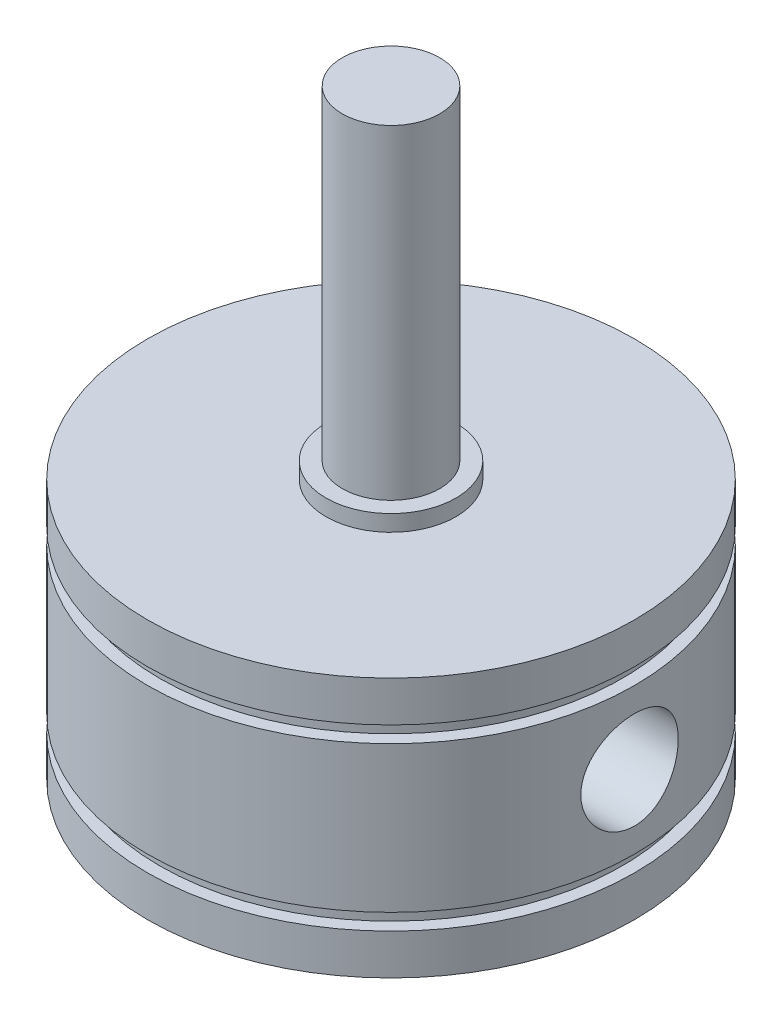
ISO-10303-21;
HEADER;
FILE_DESCRIPTION(('STEP AP214'),'2;1');
FILE_NAME('part.step','',(''),(''),'','','');
FILE_SCHEMA(('AUTOMOTIVE_DESIGN { 1 0 10303 214 1 1 1 1 }'));
ENDSEC;
DATA;
#1=APPLICATION_CONTEXT('core data for automotive mechanical design processes');
#2=APPLICATION_PROTOCOL_DEFINITION('international standard','automotive_design',2000,#1);
#3=PRODUCT_CONTEXT('',#1,'mechanical');
#4=PRODUCT('Part','Part','',(#3));
#5=PRODUCT_RELATED_PRODUCT_CATEGORY('part','',(#4));
#6=PRODUCT_DEFINITION_FORMATION('','',#4);
#7=PRODUCT_DEFINITION_CONTEXT('part definition',#1,'design');
#8=PRODUCT_DEFINITION('design','',#6,#7);
#9=PRODUCT_DEFINITION_SHAPE('','',#8);
#10=(LENGTH_UNIT() NAMED_UNIT(*) SI_UNIT(.MILLI.,.METRE.));
#11=(NAMED_UNIT(*) PLANE_ANGLE_UNIT() SI_UNIT($,.RADIAN.));
#12=(NAMED_UNIT(*) SI_UNIT($,.STERADIAN.) SOLID_ANGLE_UNIT());
#13=UNCERTAINTY_MEASURE_WITH_UNIT(LENGTH_MEASURE(1.E-05),#10,'distance_accuracy_value','');
#14=(GEOMETRIC_REPRESENTATION_CONTEXT(3) GLOBAL_UNCERTAINTY_ASSIGNED_CONTEXT((#13)) GLOBAL_UNIT_ASSIGNED_CONTEXT((#10,
#11,#12)) REPRESENTATION_CONTEXT('',''));
#15=CARTESIAN_POINT('',(0.,0.,0.));
#16=DIRECTION('',(0.,0.,1.));
#17=DIRECTION('',(1.,0.,0.));
#18=AXIS2_PLACEMENT_3D('',#15,#16,#17);
#19=CARTESIAN_POINT('',(3.,0.,0.));
#20=DIRECTION('',(0.,1.,0.));
#21=DIRECTION('',(0.,0.,1.));
#22=AXIS2_PLACEMENT_3D('',#19,#20,#21);
#23=PLANE('',#22);
#24=CARTESIAN_POINT('',(0.,0.,0.));
#25=DIRECTION('',(0.,1.,0.));
#26=DIRECTION('',(0.,0.,1.));
#27=AXIS2_PLACEMENT_3D('',#24,#25,#26);
#28=CIRCLE('',#27,3.);
#29=CARTESIAN_POINT('',(0.,0.,3.));
#30=VERTEX_POINT('',#29);
#31=EDGE_CURVE('E126',#30,#30,#28,.T.);
#32=ORIENTED_EDGE('',*,*,#31,.F.);
#33=EDGE_LOOP('',(#32));
#34=FACE_BOUND('',#33,.T.);
#35=ADVANCED_FACE('F33',(#34),#23,.F.);
#36=CARTESIAN_POINT('',(0.,41.,0.));
#37=DIRECTION('',(0.,-1.,0.));
#38=DIRECTION('',(0.,0.,-1.));
#39=AXIS2_PLACEMENT_3D('',#36,#37,#38);
#40=PLANE('',#39);
#41=CARTESIAN_POINT('',(0.,41.,0.));
#42=DIRECTION('',(0.,1.,0.));
#43=DIRECTION('',(0.,0.,1.));
#44=AXIS2_PLACEMENT_3D('',#41,#42,#43);
#45=CIRCLE('',#44,3.);
#46=CARTESIAN_POINT('',(0.,41.,3.));
#47=VERTEX_POINT('',#46);
#48=EDGE_CURVE('E63',#47,#47,#45,.T.);
#49=ORIENTED_EDGE('',*,*,#48,.T.);
#50=EDGE_LOOP('',(#49));
#51=FACE_BOUND('',#50,.T.);
#52=ADVANCED_FACE('F117',(#51),#40,.F.);
#53=CARTESIAN_POINT('',(0.,52.8834340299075,0.));
#54=DIRECTION('',(0.,1.,0.));
#55=DIRECTION('',(0.,0.,1.));
#56=AXIS2_PLACEMENT_3D('',#53,#54,#55);
#57=CYLINDRICAL_SURFACE('',#56,3.);
#58=ORIENTED_EDGE('',*,*,#48,.F.);
#59=EDGE_LOOP('',(#58));
#60=FACE_BOUND('',#59,.T.);
#61=CARTESIAN_POINT('',(0.,21.,0.));
#62=DIRECTION('',(0.,1.,0.));
#63=DIRECTION('',(0.,0.,1.));
#64=AXIS2_PLACEMENT_3D('',#61,#62,#63);
#65=CIRCLE('',#64,3.);
#66=CARTESIAN_POINT('',(0.,21.,3.));
#67=VERTEX_POINT('',#66);
#68=EDGE_CURVE('E180',#67,#67,#65,.T.);
#69=ORIENTED_EDGE('',*,*,#68,.T.);
#70=EDGE_LOOP('',(#69));
#71=FACE_BOUND('',#70,.T.);
#72=ADVANCED_FACE('F122',(#60,#71),#57,.T.);
#73=CARTESIAN_POINT('',(3.,21.,0.));
#74=DIRECTION('',(0.,-1.,0.));
#75=DIRECTION('',(0.,0.,-1.));
#76=AXIS2_PLACEMENT_3D('',#73,#74,#75);
#77=PLANE('',#76);
#78=ORIENTED_EDGE('',*,*,#68,.F.);
#79=EDGE_LOOP('',(#78));
#80=FACE_BOUND('',#79,.T.);
#81=CARTESIAN_POINT('',(0.,21.,0.));
#82=DIRECTION('',(0.,1.,0.));
#83=DIRECTION('',(0.,0.,1.));
#84=AXIS2_PLACEMENT_3D('',#81,#82,#83);
#85=CIRCLE('',#84,4.);
#86=CARTESIAN_POINT('',(0.,21.,4.));
#87=VERTEX_POINT('',#86);
#88=EDGE_CURVE('E177',#87,#87,#85,.T.);
#89=ORIENTED_EDGE('',*,*,#88,.T.);
#90=EDGE_LOOP('',(#89));
#91=FACE_BOUND('',#90,.T.);
#92=ADVANCED_FACE('F187',(#80,#91),#77,.F.);
#93=CARTESIAN_POINT('',(0.,52.8834340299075,0.));
#94=DIRECTION('',(0.,1.,0.));
#95=DIRECTION('',(0.,0.,1.));
#96=AXIS2_PLACEMENT_3D('',#93,#94,#95);
#97=CYLINDRICAL_SURFACE('',#96,4.);
#98=ORIENTED_EDGE('',*,*,#88,.F.);
#99=EDGE_LOOP('',(#98));
#100=FACE_BOUND('',#99,.T.);
#101=CARTESIAN_POINT('',(0.,20.,0.));
#102=DIRECTION('',(0.,1.,0.));
#103=DIRECTION('',(0.,0.,1.));
#104=AXIS2_PLACEMENT_3D('',#101,#102,#103);
#105=CIRCLE('',#104,4.);
#106=CARTESIAN_POINT('',(0.,20.,4.));
#107=VERTEX_POINT('',#106);
#108=EDGE_CURVE('E174',#107,#107,#105,.T.);
#109=ORIENTED_EDGE('',*,*,#108,.T.);
#110=EDGE_LOOP('',(#109));
#111=FACE_BOUND('',#110,.T.);
#112=ADVANCED_FACE('F193',(#100,#111),#97,.T.);
#113=CARTESIAN_POINT('',(4.,20.,0.));
#114=DIRECTION('',(0.,-1.,0.));
#115=DIRECTION('',(0.,0.,-1.));
#116=AXIS2_PLACEMENT_3D('',#113,#114,#115);
#117=PLANE('',#116);
#118=ORIENTED_EDGE('',*,*,#108,.F.);
#119=EDGE_LOOP('',(#118));
#120=FACE_BOUND('',#119,.T.);
#121=CARTESIAN_POINT('',(0.,20.,0.));
#122=DIRECTION('',(0.,1.,0.));
#123=DIRECTION('',(0.,0.,1.));
#124=AXIS2_PLACEMENT_3D('',#121,#122,#123);
#125=CIRCLE('',#124,15.);
#126=CARTESIAN_POINT('',(0.,20.,15.));
#127=VERTEX_POINT('',#126);
#128=EDGE_CURVE('E171',#127,#127,#125,.T.);
#129=ORIENTED_EDGE('',*,*,#128,.T.);
#130=EDGE_LOOP('',(#129));
#131=FACE_BOUND('',#130,.T.);
#132=ADVANCED_FACE('F199',(#120,#131),#117,.F.);
#133=CARTESIAN_POINT('',(0.,52.8834340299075,0.));
#134=DIRECTION('',(0.,1.,0.));
#135=DIRECTION('',(0.,0.,1.));
#136=AXIS2_PLACEMENT_3D('',#133,#134,#135);
#137=CYLINDRICAL_SURFACE('',#136,15.);
#138=ORIENTED_EDGE('',*,*,#128,.F.);
#139=EDGE_LOOP('',(#138));
#140=FACE_BOUND('',#139,.T.);
#141=CARTESIAN_POINT('',(0.,17.5,0.));
#142=DIRECTION('',(0.,1.,0.));
#143=DIRECTION('',(0.,0.,1.));
#144=AXIS2_PLACEMENT_3D('',#141,#142,#143);
#145=CIRCLE('',#144,15.);
#146=CARTESIAN_POINT('',(0.,17.5,15.));
#147=VERTEX_POINT('',#146);
#148=EDGE_CURVE('E168',#147,#147,#145,.T.);
#149=ORIENTED_EDGE('',*,*,#148,.T.);
#150=EDGE_LOOP('',(#149));
#151=FACE_BOUND('',#150,.T.);
#152=ADVANCED_FACE('F205',(#140,#151),#137,.T.);
#153=CARTESIAN_POINT('',(15.,17.5,0.));
#154=DIRECTION('',(0.,1.,0.));
#155=DIRECTION('',(0.,0.,1.));
#156=AXIS2_PLACEMENT_3D('',#153,#154,#155);
#157=PLANE('',#156);
#158=ORIENTED_EDGE('',*,*,#148,.F.);
#159=EDGE_LOOP('',(#158));
#160=FACE_BOUND('',#159,.T.);
#161=CARTESIAN_POINT('',(0.,17.5,0.));
#162=DIRECTION('',(0.,1.,0.));
#163=DIRECTION('',(0.,0.,1.));
#164=AXIS2_PLACEMENT_3D('',#161,#162,#163);
#165=CIRCLE('',#164,14.25);
#166=CARTESIAN_POINT('',(0.,17.5,14.25));
#167=VERTEX_POINT('',#166);
#168=EDGE_CURVE('E165',#167,#167,#165,.T.);
#169=ORIENTED_EDGE('',*,*,#168,.T.);
#170=EDGE_LOOP('',(#169));
#171=FACE_BOUND('',#170,.T.);
#172=ADVANCED_FACE('F211',(#160,#171),#157,.F.);
#173=CARTESIAN_POINT('',(0.,52.8834340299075,0.));
#174=DIRECTION('',(0.,1.,0.));
#175=DIRECTION('',(0.,0.,1.));
#176=AXIS2_PLACEMENT_3D('',#173,#174,#175);
#177=CYLINDRICAL_SURFACE('',#176,14.25);
#178=ORIENTED_EDGE('',*,*,#168,.F.);
#179=EDGE_LOOP('',(#178));
#180=FACE_BOUND('',#179,.T.);
#181=CARTESIAN_POINT('',(0.,16.5,0.));
#182=DIRECTION('',(0.,1.,0.));
#183=DIRECTION('',(0.,0.,1.));
#184=AXIS2_PLACEMENT_3D('',#181,#182,#183);
#185=CIRCLE('',#184,14.25);
#186=CARTESIAN_POINT('',(0.,16.5,14.25));
#187=VERTEX_POINT('',#186);
#188=EDGE_CURVE('E162',#187,#187,#185,.T.);
#189=ORIENTED_EDGE('',*,*,#188,.T.);
#190=EDGE_LOOP('',(#189));
#191=FACE_BOUND('',#190,.T.);
#192=ADVANCED_FACE('F217',(#180,#191),#177,.T.);
#193=CARTESIAN_POINT('',(14.25,16.5,0.));
#194=DIRECTION('',(0.,-1.,0.));
#195=DIRECTION('',(0.,0.,-1.));
#196=AXIS2_PLACEMENT_3D('',#193,#194,#195);
#197=PLANE('',#196);
#198=ORIENTED_EDGE('',*,*,#188,.F.);
#199=EDGE_LOOP('',(#198));
#200=FACE_BOUND('',#199,.T.);
#201=CARTESIAN_POINT('',(0.,16.5,0.));
#202=DIRECTION('',(0.,1.,0.));
#203=DIRECTION('',(0.,0.,1.));
#204=AXIS2_PLACEMENT_3D('',#201,#202,#203);
#205=CIRCLE('',#204,15.);
#206=CARTESIAN_POINT('',(0.,16.5,15.));
#207=VERTEX_POINT('',#206);
#208=EDGE_CURVE('E159',#207,#207,#205,.T.);
#209=ORIENTED_EDGE('',*,*,#208,.T.);
#210=EDGE_LOOP('',(#209));
#211=FACE_BOUND('',#210,.T.);
#212=ADVANCED_FACE('F112',(#200,#211),#197,.F.);
#213=CARTESIAN_POINT('',(0.,52.8834340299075,0.));
#214=DIRECTION('',(0.,1.,0.));
#215=DIRECTION('',(0.,0.,1.));
#216=AXIS2_PLACEMENT_3D('',#213,#214,#215);
#217=CYLINDRICAL_SURFACE('',#216,15.);
#218=CARTESIAN_POINT('',(-12.0520949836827,12.,8.93011794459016));
#219=CARTESIAN_POINT('',(-12.0521005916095,11.8333068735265,8.93011376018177));
#220=CARTESIAN_POINT('',(-12.0605846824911,11.66653613,8.91869513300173));
#221=CARTESIAN_POINT('',(-12.0940501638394,11.3377124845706,8.87325853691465));
#222=CARTESIAN_POINT('',(-12.1190447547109,11.175663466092,8.83922248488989));
#223=CARTESIAN_POINT('',(-12.1840849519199,10.8610880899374,8.74935012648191));
#224=CARTESIAN_POINT('',(-12.2241155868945,10.7085524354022,8.69353550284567));
#225=CARTESIAN_POINT('',(-12.3170872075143,10.4169754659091,8.56130049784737));
#226=CARTESIAN_POINT('',(-12.370027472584,10.2779333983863,8.48488126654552));
#227=CARTESIAN_POINT('',(-12.4869257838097,10.0153169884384,8.31190044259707));
#228=CARTESIAN_POINT('',(-12.5510150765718,9.89196123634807,8.21509563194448));
#229=CARTESIAN_POINT('',(-12.6866994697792,9.66612739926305,8.00395996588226));
#230=CARTESIAN_POINT('',(-12.7582950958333,9.56365077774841,7.88962788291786));
#231=CARTESIAN_POINT('',(-12.9064638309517,9.38163594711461,7.64485473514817));
#232=CARTESIAN_POINT('',(-12.9830748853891,9.30230545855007,7.51428194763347));
#233=CARTESIAN_POINT('',(-13.1374652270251,9.17017518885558,7.24096743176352));
#234=CARTESIAN_POINT('',(-13.2152444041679,9.11737292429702,7.09822684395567));
#235=CARTESIAN_POINT('',(-13.3679242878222,9.04047841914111,6.80627413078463));
#236=CARTESIAN_POINT('',(-13.442849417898,9.01601706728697,6.65717205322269));
#237=CARTESIAN_POINT('',(-13.5883339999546,8.99534714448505,6.35494241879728));
#238=CARTESIAN_POINT('',(-13.6588938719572,8.99913585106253,6.20181525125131));
#239=CARTESIAN_POINT('',(-13.7926797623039,9.03457854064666,5.89823062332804));
#240=CARTESIAN_POINT('',(-13.8559959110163,9.06583493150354,5.74776619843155));
#241=CARTESIAN_POINT('',(-13.9751238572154,9.15469509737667,5.45173256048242));
#242=CARTESIAN_POINT('',(-14.0309353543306,9.21229992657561,5.30616354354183));
#243=CARTESIAN_POINT('',(-14.1346638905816,9.3525901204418,5.02335824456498));
#244=CARTESIAN_POINT('',(-14.1825289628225,9.43543125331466,4.8861802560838));
#245=CARTESIAN_POINT('',(-14.2697445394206,9.62372723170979,4.62529347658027));
#246=CARTESIAN_POINT('',(-14.3090940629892,9.72918467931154,4.50158623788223));
#247=CARTESIAN_POINT('',(-14.3800850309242,9.96190086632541,4.26944609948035));
#248=CARTESIAN_POINT('',(-14.4115801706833,10.0895075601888,4.16131701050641));
#249=CARTESIAN_POINT('',(-14.4664021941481,10.3617493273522,3.96654461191));
#250=CARTESIAN_POINT('',(-14.4897289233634,10.5063847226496,3.87990170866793));
#251=CARTESIAN_POINT('',(-14.5287835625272,10.8090624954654,3.73100712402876));
#252=CARTESIAN_POINT('',(-14.5444951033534,10.967132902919,3.6688080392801));
#253=CARTESIAN_POINT('',(-14.5687095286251,11.291913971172,3.57144859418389));
#254=CARTESIAN_POINT('',(-14.5772133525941,11.4586235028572,3.53628470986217));
#255=CARTESIAN_POINT('',(-14.5872238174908,11.7928945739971,3.4947610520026));
#256=CARTESIAN_POINT('',(-14.5888476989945,11.960392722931,3.48791870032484));
#257=CARTESIAN_POINT('',(-14.5854774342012,12.294144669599,3.5019849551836));
#258=CARTESIAN_POINT('',(-14.5804836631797,12.4603985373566,3.52289198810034));
#259=CARTESIAN_POINT('',(-14.5637851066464,12.7853059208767,3.59129091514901));
#260=CARTESIAN_POINT('',(-14.55214513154,12.9440170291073,3.63852596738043));
#261=CARTESIAN_POINT('',(-14.5218434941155,13.2511898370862,3.75763421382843));
#262=CARTESIAN_POINT('',(-14.5031812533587,13.3996506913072,3.829509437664));
#263=CARTESIAN_POINT('',(-14.4580695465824,13.6842393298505,3.99646990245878));
#264=CARTESIAN_POINT('',(-14.4315217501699,13.8201811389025,4.09184545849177));
#265=CARTESIAN_POINT('',(-14.3702395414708,14.0739249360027,4.30211347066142));
#266=CARTESIAN_POINT('',(-14.3355042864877,14.1917250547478,4.41700793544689));
#267=CARTESIAN_POINT('',(-14.2568923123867,14.4076876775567,4.66455909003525));
#268=CARTESIAN_POINT('',(-14.2128834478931,14.50552096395,4.79746137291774));
#269=CARTESIAN_POINT('',(-14.1160143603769,14.6764376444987,5.07540796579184));
#270=CARTESIAN_POINT('',(-14.0631545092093,14.7495220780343,5.22045176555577));
#271=CARTESIAN_POINT('',(-13.9493649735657,14.8683866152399,5.51727394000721));
#272=CARTESIAN_POINT('',(-13.8884835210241,14.9143215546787,5.66900871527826));
#273=CARTESIAN_POINT('',(-13.7594912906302,14.9780737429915,5.97528125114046));
#274=CARTESIAN_POINT('',(-13.6913813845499,14.995894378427,6.12981867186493));
#275=CARTESIAN_POINT('',(-13.5509071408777,15.0027809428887,6.43432571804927));
#276=CARTESIAN_POINT('',(-13.4786374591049,14.9923418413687,6.58432803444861));
#277=CARTESIAN_POINT('',(-13.3310237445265,14.9440981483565,6.8782893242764));
#278=CARTESIAN_POINT('',(-13.2556797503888,14.9062939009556,7.02224837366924));
#279=CARTESIAN_POINT('',(-13.1047556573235,14.8046130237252,7.30002257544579));
#280=CARTESIAN_POINT('',(-13.0291764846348,14.7407958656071,7.43386004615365));
#281=CARTESIAN_POINT('',(-12.8805181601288,14.5889632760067,7.68856447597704));
#282=CARTESIAN_POINT('',(-12.8074392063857,14.5009459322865,7.80943040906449));
#283=CARTESIAN_POINT('',(-12.665662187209,14.3015418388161,8.03737087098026));
#284=CARTESIAN_POINT('',(-12.5970538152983,14.1898009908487,8.14419145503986));
#285=CARTESIAN_POINT('',(-12.4686405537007,13.9468492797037,8.33946608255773));
#286=CARTESIAN_POINT('',(-12.4088377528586,13.8156338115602,8.42791577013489));
#287=CARTESIAN_POINT('',(-12.3003896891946,13.5357620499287,8.58543430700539));
#288=CARTESIAN_POINT('',(-12.2518715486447,13.3869331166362,8.65428413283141));
#289=CARTESIAN_POINT('',(-12.1694754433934,13.0772016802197,8.76977426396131));
#290=CARTESIAN_POINT('',(-12.1355842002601,12.9163102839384,8.81643471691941));
#291=CARTESIAN_POINT('',(-12.0908778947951,12.6292126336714,8.8775947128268));
#292=CARTESIAN_POINT('',(-12.0763797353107,12.5046437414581,8.89726472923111));
#293=CARTESIAN_POINT('',(-12.0569863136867,12.2533981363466,8.92352771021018));
#294=CARTESIAN_POINT('',(-12.0520907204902,12.1267214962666,8.9301211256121));
#295=CARTESIAN_POINT('',(-12.0520949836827,12.,8.93011794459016));
#296=B_SPLINE_CURVE_WITH_KNOTS('',3,(#218,#219,#220,#221,#222,#223,#224,#225,#226,#227,#228,
#229,#230,#231,#232,#233,#234,#235,#236,#237,#238,#239,#240,#241,#242,#243,#244,#245,#246,#247,
#248,#249,#250,#251,#252,#253,#254,#255,#256,#257,#258,#259,#260,#261,#262,#263,#264,#265,#266,
#267,#268,#269,#270,#271,#272,#273,#274,#275,#276,#277,#278,#279,#280,#281,#282,#283,#284,#285,
#286,#287,#288,#289,#290,#291,#292,#293,#294,#295),.UNSPECIFIED.,.T.,.F.,(4,2,2,2,2,2,2,2,2,2,2,
2,2,2,2,2,2,2,2,2,2,2,2,2,2,2,2,2,2,2,2,2,2,2,2,2,2,2,4),(0.,0.499615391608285,
0.999630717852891,1.49914949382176,1.99864039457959,2.5044675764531,3.01033020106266,
3.52060201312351,4.03082604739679,4.53432746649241,5.03778036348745,5.53406368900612,
6.03036687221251,6.5297977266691,7.02928607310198,7.5374804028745,8.04568434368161,
8.55497589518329,9.06420105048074,9.5647127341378,10.0651960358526,10.5608802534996,
11.0566053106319,11.5587917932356,12.0610299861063,12.5709780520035,13.0809046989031,
13.5878944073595,14.0948230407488,14.5929305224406,15.0910317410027,15.5880005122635,
16.0850085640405,16.5900345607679,17.0951801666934,17.6057669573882,18.1158892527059,
18.4957141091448,18.8755258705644),.UNSPECIFIED.);
#297=CARTESIAN_POINT('',(-12.0520949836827,12.,8.93011794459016));
#298=VERTEX_POINT('',#297);
#299=EDGE_CURVE('E129',#298,#298,#296,.T.);
#300=ORIENTED_EDGE('',*,*,#299,.T.);
#301=EDGE_LOOP('',(#300));
#302=FACE_BOUND('',#301,.T.);
#303=CARTESIAN_POINT('',(15.,15.,0.));
#304=CARTESIAN_POINT('',(14.9999969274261,14.999993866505,-0.1667307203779));
#305=CARTESIAN_POINT('',(14.9971915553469,14.9860534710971,-0.333538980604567));
#306=CARTESIAN_POINT('',(14.9862709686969,14.9307044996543,-0.662440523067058));
#307=CARTESIAN_POINT('',(14.9781515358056,14.8892741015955,-0.824529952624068));
#308=CARTESIAN_POINT('',(14.9575094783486,14.7802761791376,-1.13919091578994));
#309=CARTESIAN_POINT('',(14.9449910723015,14.7127336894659,-1.2917714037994));
#310=CARTESIAN_POINT('',(14.9169119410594,14.5535032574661,-1.58342396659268));
#311=CARTESIAN_POINT('',(14.9013513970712,14.4618167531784,-1.72249684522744));
#312=CARTESIAN_POINT('',(14.8686649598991,14.2555845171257,-1.9850804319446));
#313=CARTESIAN_POINT('',(14.8515223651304,14.1407749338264,-2.10838185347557));
#314=CARTESIAN_POINT('',(14.8177254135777,13.8921227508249,-2.33411026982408));
#315=CARTESIAN_POINT('',(14.8010710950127,13.7582786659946,-2.43653563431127));
#316=CARTESIAN_POINT('',(14.7699732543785,13.4738514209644,-2.61849526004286));
#317=CARTESIAN_POINT('',(14.7555512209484,13.3231270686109,-2.6978128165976));
#318=CARTESIAN_POINT('',(14.7307880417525,13.0101545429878,-2.82991699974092));
#319=CARTESIAN_POINT('',(14.7204464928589,12.847907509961,-2.88270624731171));
#320=CARTESIAN_POINT('',(14.7051841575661,12.5187469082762,-2.95957589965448));
#321=CARTESIAN_POINT('',(14.7001941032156,12.3519223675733,-2.98402349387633));
#322=CARTESIAN_POINT('',(14.6959912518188,12.016470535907,-3.00465638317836));
#323=CARTESIAN_POINT('',(14.6967778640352,11.8478434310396,-3.0008445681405));
#324=CARTESIAN_POINT('',(14.7039765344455,11.516259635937,-2.96536371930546));
#325=CARTESIAN_POINT('',(14.7103035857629,11.3532557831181,-2.93411562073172));
#326=CARTESIAN_POINT('',(14.7277363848,11.034851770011,-2.84531365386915));
#327=CARTESIAN_POINT('',(14.7388423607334,10.879451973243,-2.78775852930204));
#328=CARTESIAN_POINT('',(14.7646685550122,10.5794542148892,-2.64757435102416));
#329=CARTESIAN_POINT('',(14.7794126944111,10.4349363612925,-2.56477845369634));
#330=CARTESIAN_POINT('',(14.8108385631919,10.1616874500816,-2.37658072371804));
#331=CARTESIAN_POINT('',(14.827520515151,10.0329582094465,-2.27117629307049));
#332=CARTESIAN_POINT('',(14.8613106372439,9.79251179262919,-2.03849980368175));
#333=CARTESIAN_POINT('',(14.8784210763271,9.68114229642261,-1.91086848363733));
#334=CARTESIAN_POINT('',(14.9108654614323,9.48133846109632,-1.63855507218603));
#335=CARTESIAN_POINT('',(14.9261993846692,9.39290441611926,-1.49387276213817));
#336=CARTESIAN_POINT('',(14.9534007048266,9.24141747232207,-1.19117816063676));
#337=CARTESIAN_POINT('',(14.9652626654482,9.17840431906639,-1.0331454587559));
#338=CARTESIAN_POINT('',(14.9841422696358,9.0799185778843,-0.708446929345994));
#339=CARTESIAN_POINT('',(14.9911605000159,9.04444265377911,-0.541782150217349));
#340=CARTESIAN_POINT('',(14.999480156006,9.00253063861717,-0.207538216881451));
#341=CARTESIAN_POINT('',(15.0008752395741,8.99561874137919,-0.0400209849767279));
#342=CARTESIAN_POINT('',(14.9980515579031,9.00974957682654,0.293774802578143));
#343=CARTESIAN_POINT('',(14.9938331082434,9.03079073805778,0.46005342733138));
#344=CARTESIAN_POINT('',(14.9803149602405,9.09983512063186,0.785116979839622));
#345=CARTESIAN_POINT('',(14.9710612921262,9.14759420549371,0.943955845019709));
#346=CARTESIAN_POINT('',(14.948506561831,9.26845194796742,1.251370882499));
#347=CARTESIAN_POINT('',(14.9352051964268,9.34155250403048,1.39994628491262));
#348=CARTESIAN_POINT('',(14.9057973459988,9.51204747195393,1.68462352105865));
#349=CARTESIAN_POINT('',(14.8896585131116,9.60972834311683,1.82055038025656));
#350=CARTESIAN_POINT('',(14.8564420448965,9.82622757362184,2.07425405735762));
#351=CARTESIAN_POINT('',(14.8393643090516,9.9450481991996,2.19202892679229));
#352=CARTESIAN_POINT('',(14.805879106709,10.2026200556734,2.40792177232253));
#353=CARTESIAN_POINT('',(14.7894858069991,10.341647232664,2.50571310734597));
#354=CARTESIAN_POINT('',(14.7595257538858,10.63443408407,2.67655626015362));
#355=CARTESIAN_POINT('',(14.7459588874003,10.7881931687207,2.74960906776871));
#356=CARTESIAN_POINT('',(14.7233022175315,11.1053047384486,2.86845552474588));
#357=CARTESIAN_POINT('',(14.7141892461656,11.268602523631,2.91439049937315));
#358=CARTESIAN_POINT('',(14.7014231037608,11.6008003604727,2.97812595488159));
#359=CARTESIAN_POINT('',(14.6977692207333,11.769699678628,2.99593010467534));
#360=CARTESIAN_POINT('',(14.6963744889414,12.105026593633,3.00276273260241));
#361=CARTESIAN_POINT('',(14.698527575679,12.271443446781,2.99230736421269));
#362=CARTESIAN_POINT('',(14.7082672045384,12.6000949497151,2.94405691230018));
#363=CARTESIAN_POINT('',(14.7158537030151,12.7623296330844,2.90626204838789));
#364=CARTESIAN_POINT('',(14.7355579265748,13.0776831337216,2.80463570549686));
#365=CARTESIAN_POINT('',(14.7476646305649,13.2308230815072,2.74086752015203));
#366=CARTESIAN_POINT('',(14.7750514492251,13.5243111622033,2.58916393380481));
#367=CARTESIAN_POINT('',(14.7903318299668,13.6646582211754,2.50122650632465));
#368=CARTESIAN_POINT('',(14.8226688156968,13.9311467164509,2.30191774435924));
#369=CARTESIAN_POINT('',(14.839751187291,14.0570062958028,2.19017366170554));
#370=CARTESIAN_POINT('',(14.8735824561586,14.2883586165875,1.94719310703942));
#371=CARTESIAN_POINT('',(14.8903312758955,14.3938466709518,1.81595216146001));
#372=CARTESIAN_POINT('',(14.9218149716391,14.5825039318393,1.53605288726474));
#373=CARTESIAN_POINT('',(14.9365269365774,14.6654280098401,1.38722665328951));
#374=CARTESIAN_POINT('',(14.96205375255,14.8049583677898,1.0774990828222));
#375=CARTESIAN_POINT('',(14.9728721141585,14.8615883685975,0.916608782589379));
#376=CARTESIAN_POINT('',(14.9872911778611,14.9359558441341,0.62946446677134));
#377=CARTESIAN_POINT('',(14.9920290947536,14.9599295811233,0.504844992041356));
#378=CARTESIAN_POINT('',(14.9983846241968,14.9919537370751,0.253498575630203));
#379=CARTESIAN_POINT('',(15.0000023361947,15.0000046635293,0.126771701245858));
#380=CARTESIAN_POINT('',(15.,15.,0.));
#381=B_SPLINE_CURVE_WITH_KNOTS('',3,(#303,#304,#305,#306,#307,#308,#309,#310,#311,#312,#313,
#314,#315,#316,#317,#318,#319,#320,#321,#322,#323,#324,#325,#326,#327,#328,#329,#330,#331,#332,
#333,#334,#335,#336,#337,#338,#339,#340,#341,#342,#343,#344,#345,#346,#347,#348,#349,#350,#351,
#352,#353,#354,#355,#356,#357,#358,#359,#360,#361,#362,#363,#364,#365,#366,#367,#368,#369,#370,
#371,#372,#373,#374,#375,#376,#377,#378,#379,#380),.UNSPECIFIED.,.T.,.F.,(4,2,2,2,2,2,2,2,2,2,2,
2,2,2,2,2,2,2,2,2,2,2,2,2,2,2,2,2,2,2,2,2,2,2,2,2,2,2,4),(0.,0.499728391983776,0.99985395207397,
1.49950120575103,1.99911870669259,2.50479801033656,3.0105167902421,3.52083585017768,
4.03110448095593,4.53468555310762,5.03821512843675,5.53415181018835,6.03011217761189,
6.52942470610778,7.02879464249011,7.53714757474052,8.04550702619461,8.55465824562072,
9.06374777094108,9.56432207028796,10.064868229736,10.5609136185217,11.0569961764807,
11.5591519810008,12.0613616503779,12.5712188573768,13.081055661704,13.5882114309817,
14.0953010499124,14.593191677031,15.0910783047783,15.5877588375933,16.084481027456,
16.5896422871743,17.0949196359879,17.6054849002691,18.1155886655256,18.4955632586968,
18.8755257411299),.UNSPECIFIED.);
#382=CARTESIAN_POINT('',(15.,15.,0.));
#383=VERTEX_POINT('',#382);
#384=EDGE_CURVE('E49',#383,#383,#381,.T.);
#385=ORIENTED_EDGE('',*,*,#384,.T.);
#386=EDGE_LOOP('',(#385));
#387=FACE_BOUND('',#386,.T.);
#388=CARTESIAN_POINT('',(-14.6969384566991,12.,3.));
#389=CARTESIAN_POINT('',(-14.6969417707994,11.8333068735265,2.99999383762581));
#390=CARTESIAN_POINT('',(-14.6998052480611,11.66653613,2.98605951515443));
#391=CARTESIAN_POINT('',(-14.7109329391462,11.3377124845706,2.93073685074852));
#392=CARTESIAN_POINT('',(-14.7192014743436,11.1756634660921,2.88932654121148));
#393=CARTESIAN_POINT('',(-14.7401662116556,10.8610880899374,2.78038734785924));
#394=CARTESIAN_POINT('',(-14.7528580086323,10.7085524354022,2.71288444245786));
#395=CARTESIAN_POINT('',(-14.7812339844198,10.4169754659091,2.55374732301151));
#396=CARTESIAN_POINT('',(-14.7969179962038,10.2779333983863,2.46211445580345));
#397=CARTESIAN_POINT('',(-14.8297589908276,10.0153169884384,2.25593722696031));
#398=CARTESIAN_POINT('',(-14.8469321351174,9.89196123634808,2.14111696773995));
#399=CARTESIAN_POINT('',(-14.880674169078,9.66612739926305,1.89242036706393));
#400=CARTESIAN_POINT('',(-14.897243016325,9.56365077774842,1.75854269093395));
#401=CARTESIAN_POINT('',(-14.9280838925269,9.38163594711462,1.47408406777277));
#402=CARTESIAN_POINT('',(-14.9423346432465,9.30230545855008,1.32336770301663));
#403=CARTESIAN_POINT('',(-14.9667521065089,9.17017518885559,1.01041245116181));
#404=CARTESIAN_POINT('',(-14.9769192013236,9.11737292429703,0.848174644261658));
#405=CARTESIAN_POINT('',(-14.9919096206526,9.04047841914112,0.519050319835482));
#406=CARTESIAN_POINT('',(-14.9968015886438,9.01601706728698,0.352253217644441));
#407=CARTESIAN_POINT('',(-15.0009276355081,8.99534714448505,0.0168557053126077));
#408=CARTESIAN_POINT('',(-15.0001622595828,8.99913585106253,-0.151744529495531));
#409=CARTESIAN_POINT('',(-14.9931130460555,9.03457854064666,-0.483426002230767));
#410=CARTESIAN_POINT('',(-14.9869079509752,9.06583493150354,-0.646551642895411));
#411=CARTESIAN_POINT('',(-14.9697653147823,9.15469509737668,-0.965194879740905));
#412=CARTESIAN_POINT('',(-14.9588275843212,9.21229992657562,-1.12071217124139));
#413=CARTESIAN_POINT('',(-14.9333188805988,9.3525901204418,-1.42085838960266));
#414=CARTESIAN_POINT('',(-14.9187254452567,9.43543125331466,-1.5654125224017));
#415=CARTESIAN_POINT('',(-14.8875140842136,9.6237272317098,-1.83871513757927));
#416=CARTESIAN_POINT('',(-14.8708959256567,9.72918467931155,-1.967461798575));
#417=CARTESIAN_POINT('',(-14.8371289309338,9.96190086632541,-2.20785429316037));
#418=CARTESIAN_POINT('',(-14.8199758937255,10.0895075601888,-2.31916294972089));
#419=CARTESIAN_POINT('',(-14.7873471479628,10.3617493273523,-2.51885547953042));
#420=CARTESIAN_POINT('',(-14.7718714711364,10.5063847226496,-2.60723891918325));
#421=CARTESIAN_POINT('',(-14.7443414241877,10.8090624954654,-2.75868844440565));
#422=CARTESIAN_POINT('',(-14.7322944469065,10.967132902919,-2.82169994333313));
#423=CARTESIAN_POINT('',(-14.7130942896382,11.291913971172,-2.92017102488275));
#424=CARTESIAN_POINT('',(-14.7059404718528,11.4586235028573,-2.95563419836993));
#425=CARTESIAN_POINT('',(-14.6974643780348,11.7928945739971,-2.99749801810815));
#426=CARTESIAN_POINT('',(-14.6960444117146,11.960392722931,-3.00438557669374));
#427=CARTESIAN_POINT('',(-14.6989345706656,12.294144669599,-2.99021288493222));
#428=CARTESIAN_POINT('',(-14.7032443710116,12.4603985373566,-2.96915421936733));
#429=CARTESIAN_POINT('',(-14.7170169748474,12.7853059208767,-2.90010662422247));
#430=CARTESIAN_POINT('',(-14.7264299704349,12.9440170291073,-2.85237786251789));
#431=CARTESIAN_POINT('',(-14.7493046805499,13.2511898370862,-2.73162310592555));
#432=CARTESIAN_POINT('',(-14.7627667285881,13.3996506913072,-2.65859502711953));
#433=CARTESIAN_POINT('',(-14.7924421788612,13.6842393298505,-2.48821242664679));
#434=CARTESIAN_POINT('',(-14.8086891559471,13.8201811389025,-2.39055323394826));
#435=CARTESIAN_POINT('',(-14.8420117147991,14.0739249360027,-2.17408671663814));
#436=CARTESIAN_POINT('',(-14.8590873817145,14.1917250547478,-2.05527721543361));
#437=CARTESIAN_POINT('',(-14.8924603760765,14.4076876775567,-1.79769682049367));
#438=CARTESIAN_POINT('',(-14.9087417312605,14.50552096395,-1.65864749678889));
#439=CARTESIAN_POINT('',(-14.9384138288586,14.6764376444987,-1.36580368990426));
#440=CARTESIAN_POINT('',(-14.9518046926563,14.7495220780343,-1.21200982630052));
#441=CARTESIAN_POINT('',(-14.974118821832,14.8683866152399,-0.894908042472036));
#442=CARTESIAN_POINT('',(-14.9830673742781,14.9143215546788,-0.731660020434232));
#443=CARTESIAN_POINT('',(-14.9955970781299,14.9780737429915,-0.399568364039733));
#444=CARTESIAN_POINT('',(-14.9991788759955,14.995894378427,-0.230725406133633));
#445=CARTESIAN_POINT('',(-15.0005562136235,15.0027809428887,0.104618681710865));
#446=CARTESIAN_POINT('',(-14.9984513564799,14.9923418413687,0.271109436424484));
#447=CARTESIAN_POINT('',(-14.9889013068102,14.9440981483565,0.599913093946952));
#448=CARTESIAN_POINT('',(-14.9814561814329,14.9062939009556,0.762226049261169));
#449=CARTESIAN_POINT('',(-14.9620649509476,14.8046130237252,1.0777582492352));
#450=CARTESIAN_POINT('',(-14.9501291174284,14.7407958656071,1.2309973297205));
#451=CARTESIAN_POINT('',(-14.9230416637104,14.5889632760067,1.52466366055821));
#452=CARTESIAN_POINT('',(-14.9078897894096,14.5009459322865,1.66508989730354));
#453=CARTESIAN_POINT('',(-14.8757279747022,14.3015418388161,1.93159167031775));
#454=CARTESIAN_POINT('',(-14.858692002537,14.1898009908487,2.05739914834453));
#455=CARTESIAN_POINT('',(-14.824836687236,13.9468492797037,2.28864785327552));
#456=CARTESIAN_POINT('',(-14.8080173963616,13.8156338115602,2.39408424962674));
#457=CARTESIAN_POINT('',(-14.7763002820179,13.5357620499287,2.58267665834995));
#458=CARTESIAN_POINT('',(-14.7614251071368,13.3869331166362,2.66558044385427));
#459=CARTESIAN_POINT('',(-14.7355571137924,13.0772016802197,2.80507214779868));
#460=CARTESIAN_POINT('',(-14.7245607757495,12.9163102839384,2.86168393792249));
#461=CARTESIAN_POINT('',(-14.7098904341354,12.6292126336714,2.93600741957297));
#462=CARTESIAN_POINT('',(-14.7050635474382,12.5046437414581,2.95996169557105));
#463=CARTESIAN_POINT('',(-14.6985863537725,12.2533981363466,2.99196005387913));
#464=CARTESIAN_POINT('',(-14.6969359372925,12.1267214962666,3.00000468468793));
#465=CARTESIAN_POINT('',(-14.6969384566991,12.,3.));
#466=B_SPLINE_CURVE_WITH_KNOTS('',3,(#388,#389,#390,#391,#392,#393,#394,#395,#396,#397,#398,
#399,#400,#401,#402,#403,#404,#405,#406,#407,#408,#409,#410,#411,#412,#413,#414,#415,#416,#417,
#418,#419,#420,#421,#422,#423,#424,#425,#426,#427,#428,#429,#430,#431,#432,#433,#434,#435,#436,
#437,#438,#439,#440,#441,#442,#443,#444,#445,#446,#447,#448,#449,#450,#451,#452,#453,#454,#455,
#456,#457,#458,#459,#460,#461,#462,#463,#464,#465),.UNSPECIFIED.,.T.,.F.,(4,2,2,2,2,2,2,2,2,2,2,
2,2,2,2,2,2,2,2,2,2,2,2,2,2,2,2,2,2,2,2,2,2,2,2,2,2,2,4),(0.,0.499615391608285,
0.999630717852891,1.49914949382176,1.99864039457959,2.50446757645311,3.01033020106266,
3.52060201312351,4.03082604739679,4.53432746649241,5.03778036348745,5.53406368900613,
6.03036687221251,6.5297977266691,7.02928607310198,7.5374804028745,8.04568434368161,
8.5549758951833,9.06420105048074,9.56471273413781,10.0651960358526,10.5608802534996,
11.056605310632,11.5587917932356,12.0610299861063,12.5709780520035,13.0809046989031,
13.5878944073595,14.0948230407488,14.5929305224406,15.0910317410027,15.5880005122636,
16.0850085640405,16.5900345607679,17.0951801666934,17.6057669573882,18.1158892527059,
18.4957141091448,18.8755258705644),.UNSPECIFIED.);
#467=CARTESIAN_POINT('',(-14.6969384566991,12.,3.));
#468=VERTEX_POINT('',#467);
#469=EDGE_CURVE('E58',#468,#468,#466,.T.);
#470=ORIENTED_EDGE('',*,*,#469,.T.);
#471=EDGE_LOOP('',(#470));
#472=FACE_BOUND('',#471,.T.);
#473=ORIENTED_EDGE('',*,*,#208,.F.);
#474=EDGE_LOOP('',(#473));
#475=FACE_BOUND('',#474,.T.);
#476=CARTESIAN_POINT('',(0.,7.49999999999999,0.));
#477=DIRECTION('',(0.,1.,0.));
#478=DIRECTION('',(0.,0.,1.));
#479=AXIS2_PLACEMENT_3D('',#476,#477,#478);
#480=CIRCLE('',#479,15.);
#481=CARTESIAN_POINT('',(0.,7.49999999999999,15.));
#482=VERTEX_POINT('',#481);
#483=EDGE_CURVE('E156',#482,#482,#480,.T.);
#484=ORIENTED_EDGE('',*,*,#483,.T.);
#485=EDGE_LOOP('',(#484));
#486=FACE_BOUND('',#485,.T.);
#487=ADVANCED_FACE('F71',(#302,#387,#472,#475,#486),#217,.T.);
#488=CARTESIAN_POINT('',(15.,7.49999999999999,0.));
#489=DIRECTION('',(0.,1.,0.));
#490=DIRECTION('',(0.,0.,1.));
#491=AXIS2_PLACEMENT_3D('',#488,#489,#490);
#492=PLANE('',#491);
#493=ORIENTED_EDGE('',*,*,#483,.F.);
#494=EDGE_LOOP('',(#493));
#495=FACE_BOUND('',#494,.T.);
#496=CARTESIAN_POINT('',(0.,7.49999999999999,0.));
#497=DIRECTION('',(0.,1.,0.));
#498=DIRECTION('',(0.,0.,1.));
#499=AXIS2_PLACEMENT_3D('',#496,#497,#498);
#500=CIRCLE('',#499,14.25);
#501=CARTESIAN_POINT('',(0.,7.49999999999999,14.25));
#502=VERTEX_POINT('',#501);
#503=EDGE_CURVE('E153',#502,#502,#500,.T.);
#504=ORIENTED_EDGE('',*,*,#503,.T.);
#505=EDGE_LOOP('',(#504));
#506=FACE_BOUND('',#505,.T.);
#507=ADVANCED_FACE('F105',(#495,#506),#492,.F.);
#508=CARTESIAN_POINT('',(0.,52.8834340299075,0.));
#509=DIRECTION('',(0.,1.,0.));
#510=DIRECTION('',(0.,0.,1.));
#511=AXIS2_PLACEMENT_3D('',#508,#509,#510);
#512=CYLINDRICAL_SURFACE('',#511,14.25);
#513=ORIENTED_EDGE('',*,*,#503,.F.);
#514=EDGE_LOOP('',(#513));
#515=FACE_BOUND('',#514,.T.);
#516=CARTESIAN_POINT('',(0.,6.49999999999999,0.));
#517=DIRECTION('',(0.,1.,0.));
#518=DIRECTION('',(0.,0.,1.));
#519=AXIS2_PLACEMENT_3D('',#516,#517,#518);
#520=CIRCLE('',#519,14.25);
#521=CARTESIAN_POINT('',(0.,6.49999999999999,14.25));
#522=VERTEX_POINT('',#521);
#523=EDGE_CURVE('E150',#522,#522,#520,.T.);
#524=ORIENTED_EDGE('',*,*,#523,.T.);
#525=EDGE_LOOP('',(#524));
#526=FACE_BOUND('',#525,.T.);
#527=ADVANCED_FACE('F102',(#515,#526),#512,.T.);
#528=CARTESIAN_POINT('',(14.25,6.49999999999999,0.));
#529=DIRECTION('',(0.,-1.,0.));
#530=DIRECTION('',(0.,0.,-1.));
#531=AXIS2_PLACEMENT_3D('',#528,#529,#530);
#532=PLANE('',#531);
#533=ORIENTED_EDGE('',*,*,#523,.F.);
#534=EDGE_LOOP('',(#533));
#535=FACE_BOUND('',#534,.T.);
#536=CARTESIAN_POINT('',(0.,6.49999999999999,0.));
#537=DIRECTION('',(0.,1.,0.));
#538=DIRECTION('',(0.,0.,1.));
#539=AXIS2_PLACEMENT_3D('',#536,#537,#538);
#540=CIRCLE('',#539,15.);
#541=CARTESIAN_POINT('',(0.,6.49999999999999,15.));
#542=VERTEX_POINT('',#541);
#543=EDGE_CURVE('E147',#542,#542,#540,.T.);
#544=ORIENTED_EDGE('',*,*,#543,.T.);
#545=EDGE_LOOP('',(#544));
#546=FACE_BOUND('',#545,.T.);
#547=ADVANCED_FACE('F98',(#535,#546),#532,.F.);
#548=CARTESIAN_POINT('',(0.,52.8834340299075,0.));
#549=DIRECTION('',(0.,1.,0.));
#550=DIRECTION('',(0.,0.,1.));
#551=AXIS2_PLACEMENT_3D('',#548,#549,#550);
#552=CYLINDRICAL_SURFACE('',#551,15.);
#553=ORIENTED_EDGE('',*,*,#543,.F.);
#554=EDGE_LOOP('',(#553));
#555=FACE_BOUND('',#554,.T.);
#556=CARTESIAN_POINT('',(0.,3.99999999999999,0.));
#557=DIRECTION('',(0.,1.,0.));
#558=DIRECTION('',(0.,0.,1.));
#559=AXIS2_PLACEMENT_3D('',#556,#557,#558);
#560=CIRCLE('',#559,15.);
#561=CARTESIAN_POINT('',(0.,3.99999999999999,15.));
#562=VERTEX_POINT('',#561);
#563=EDGE_CURVE('E144',#562,#562,#560,.T.);
#564=ORIENTED_EDGE('',*,*,#563,.T.);
#565=EDGE_LOOP('',(#564));
#566=FACE_BOUND('',#565,.T.);
#567=ADVANCED_FACE('F94',(#555,#566),#552,.T.);
#568=CARTESIAN_POINT('',(15.,3.99999999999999,0.));
#569=DIRECTION('',(0.,1.,0.));
#570=DIRECTION('',(0.,0.,1.));
#571=AXIS2_PLACEMENT_3D('',#568,#569,#570);
#572=PLANE('',#571);
#573=ORIENTED_EDGE('',*,*,#563,.F.);
#574=EDGE_LOOP('',(#573));
#575=FACE_BOUND('',#574,.T.);
#576=CARTESIAN_POINT('',(0.,3.99999999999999,0.));
#577=DIRECTION('',(0.,1.,0.));
#578=DIRECTION('',(0.,0.,1.));
#579=AXIS2_PLACEMENT_3D('',#576,#577,#578);
#580=CIRCLE('',#579,4.);
#581=CARTESIAN_POINT('',(0.,3.99999999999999,4.));
#582=VERTEX_POINT('',#581);
#583=EDGE_CURVE('E141',#582,#582,#580,.T.);
#584=ORIENTED_EDGE('',*,*,#583,.T.);
#585=EDGE_LOOP('',(#584));
#586=FACE_BOUND('',#585,.T.);
#587=ADVANCED_FACE('F90',(#575,#586),#572,.F.);
#588=CARTESIAN_POINT('',(0.,52.8834340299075,0.));
#589=DIRECTION('',(0.,1.,0.));
#590=DIRECTION('',(0.,0.,1.));
#591=AXIS2_PLACEMENT_3D('',#588,#589,#590);
#592=CYLINDRICAL_SURFACE('',#591,4.);
#593=ORIENTED_EDGE('',*,*,#583,.F.);
#594=EDGE_LOOP('',(#593));
#595=FACE_BOUND('',#594,.T.);
#596=CARTESIAN_POINT('',(0.,3.,0.));
#597=DIRECTION('',(0.,1.,0.));
#598=DIRECTION('',(0.,0.,1.));
#599=AXIS2_PLACEMENT_3D('',#596,#597,#598);
#600=CIRCLE('',#599,4.);
#601=CARTESIAN_POINT('',(0.,3.,4.));
#602=VERTEX_POINT('',#601);
#603=EDGE_CURVE('E132',#602,#602,#600,.T.);
#604=ORIENTED_EDGE('',*,*,#603,.T.);
#605=EDGE_LOOP('',(#604));
#606=FACE_BOUND('',#605,.T.);
#607=ADVANCED_FACE('F86',(#595,#606),#592,.T.);
#608=CARTESIAN_POINT('',(4.,3.,0.));
#609=DIRECTION('',(0.,1.,0.));
#610=DIRECTION('',(0.,0.,1.));
#611=AXIS2_PLACEMENT_3D('',#608,#609,#610);
#612=PLANE('',#611);
#613=ORIENTED_EDGE('',*,*,#603,.F.);
#614=EDGE_LOOP('',(#613));
#615=FACE_BOUND('',#614,.T.);
#616=CARTESIAN_POINT('',(0.,3.,0.));
#617=DIRECTION('',(0.,1.,0.));
#618=DIRECTION('',(0.,0.,1.));
#619=AXIS2_PLACEMENT_3D('',#616,#617,#618);
#620=CIRCLE('',#619,3.);
#621=CARTESIAN_POINT('',(0.,3.,3.));
#622=VERTEX_POINT('',#621);
#623=EDGE_CURVE('E128',#622,#622,#620,.T.);
#624=ORIENTED_EDGE('',*,*,#623,.T.);
#625=EDGE_LOOP('',(#624));
#626=FACE_BOUND('',#625,.T.);
#627=ADVANCED_FACE('F82',(#615,#626),#612,.F.);
#628=CARTESIAN_POINT('',(0.,52.8834340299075,0.));
#629=DIRECTION('',(0.,1.,0.));
#630=DIRECTION('',(0.,0.,1.));
#631=AXIS2_PLACEMENT_3D('',#628,#629,#630);
#632=CYLINDRICAL_SURFACE('',#631,3.);
#633=ORIENTED_EDGE('',*,*,#623,.F.);
#634=EDGE_LOOP('',(#633));
#635=FACE_BOUND('',#634,.T.);
#636=ORIENTED_EDGE('',*,*,#31,.T.);
#637=EDGE_LOOP('',(#636));
#638=FACE_BOUND('',#637,.T.);
#639=ADVANCED_FACE('F53',(#635,#638),#632,.T.);
#640=CARTESIAN_POINT('',(15.,12.,0.));
#641=DIRECTION('',(-1.,0.,0.));
#642=DIRECTION('',(0.,0.,1.));
#643=AXIS2_PLACEMENT_3D('',#640,#641,#642);
#644=CYLINDRICAL_SURFACE('',#643,3.);
#645=CARTESIAN_POINT('',(0.,12.,0.));
#646=DIRECTION('',(-0.216439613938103,0.,-0.976296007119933));
#647=DIRECTION('',(-0.976296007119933,0.,0.216439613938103));
#648=AXIS2_PLACEMENT_3D('',#645,#646,#647);
#649=ELLIPSE('',#648,13.8606789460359,3.);
#650=CARTESIAN_POINT('',(0.,15.,0.));
#651=VERTEX_POINT('',#650);
#652=CARTESIAN_POINT('',(0.,9.,0.));
#653=VERTEX_POINT('',#652);
#654=EDGE_CURVE('E40',#651,#653,#649,.F.);
#655=ORIENTED_EDGE('',*,*,#654,.T.);
#656=CARTESIAN_POINT('',(0.,12.,0.));
#657=DIRECTION('',(-0.976296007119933,0.,0.216439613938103));
#658=DIRECTION('',(-0.216439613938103,0.,-0.976296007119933));
#659=AXIS2_PLACEMENT_3D('',#656,#657,#658);
#660=ELLIPSE('',#659,3.07283854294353,3.);
#661=EDGE_CURVE('E11',#653,#651,#660,.T.);
#662=ORIENTED_EDGE('',*,*,#661,.T.);
#663=EDGE_LOOP('',(#655,#662));
#664=FACE_BOUND('',#663,.T.);
#665=ORIENTED_EDGE('',*,*,#469,.F.);
#666=EDGE_LOOP('',(#665));
#667=FACE_BOUND('',#666,.T.);
#668=ORIENTED_EDGE('',*,*,#384,.F.);
#669=EDGE_LOOP('',(#668));
#670=FACE_BOUND('',#669,.T.);
#671=ADVANCED_FACE('F50',(#664,#667,#670),#644,.F.);
#672=CARTESIAN_POINT('',(0.,12.,0.));
#673=DIRECTION('',(-0.90630778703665,0.,0.4226182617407));
#674=DIRECTION('',(0.4226182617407,0.,0.90630778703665));
#675=AXIS2_PLACEMENT_3D('',#672,#673,#674);
#676=CYLINDRICAL_SURFACE('',#675,3.);
#677=ORIENTED_EDGE('',*,*,#654,.F.);
#678=ORIENTED_EDGE('',*,*,#661,.F.);
#679=EDGE_LOOP('',(#677,#678));
#680=FACE_BOUND('',#679,.T.);
#681=ORIENTED_EDGE('',*,*,#299,.F.);
#682=EDGE_LOOP('',(#681));
#683=FACE_BOUND('',#682,.T.);
#684=ADVANCED_FACE('F46',(#680,#683),#676,.F.);
#685=CLOSED_SHELL('',(#35,#52,#72,#92,#112,#132,#152,#172,#192,#212,#487,#507,#527,#547,#567,
#587,#607,#627,#639,#671,#684));
#686=MANIFOLD_SOLID_BREP('B2',#685);
#687=ADVANCED_BREP_SHAPE_REPRESENTATION('',(#18,#686),#14);
#688=SHAPE_DEFINITION_REPRESENTATION(#9,#687);
ENDSEC;
END-ISO-10303-21;
